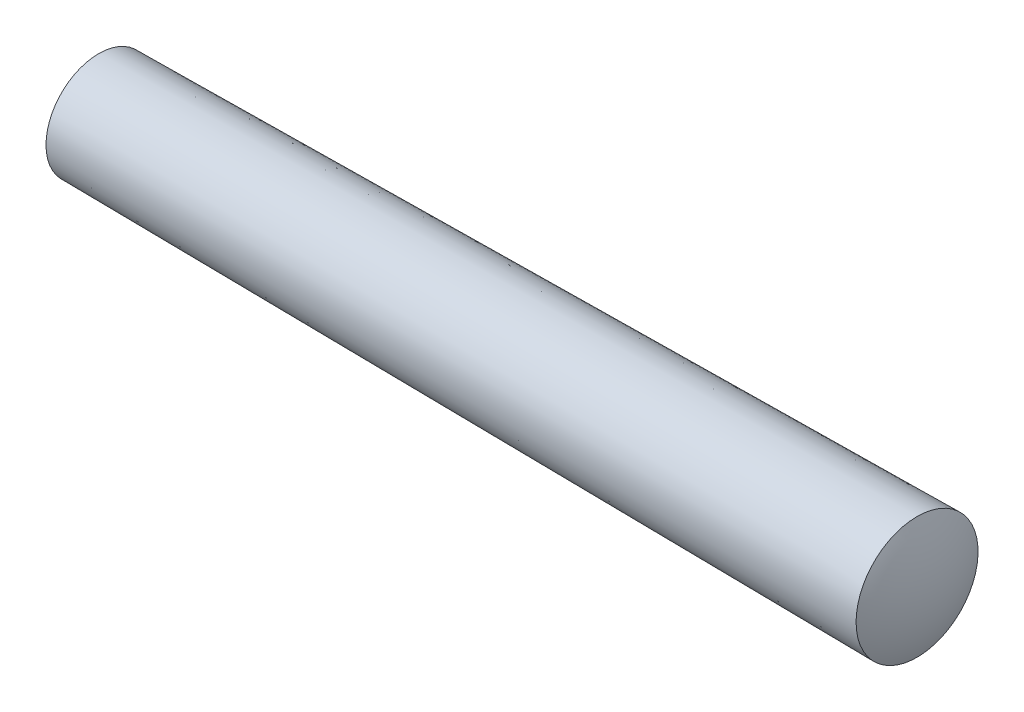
ISO-10303-21;
HEADER;
FILE_DESCRIPTION(('STEP AP214'),'2;1');
FILE_NAME('part.step','',(''),(''),'','','');
FILE_SCHEMA(('AUTOMOTIVE_DESIGN { 1 0 10303 214 1 1 1 1 }'));
ENDSEC;
DATA;
#1=APPLICATION_CONTEXT('core data for automotive mechanical design processes');
#2=APPLICATION_PROTOCOL_DEFINITION('international standard','automotive_design',2000,#1);
#3=PRODUCT_CONTEXT('',#1,'mechanical');
#4=PRODUCT('Part','Part','',(#3));
#5=PRODUCT_RELATED_PRODUCT_CATEGORY('part','',(#4));
#6=PRODUCT_DEFINITION_FORMATION('','',#4);
#7=PRODUCT_DEFINITION_CONTEXT('part definition',#1,'design');
#8=PRODUCT_DEFINITION('design','',#6,#7);
#9=PRODUCT_DEFINITION_SHAPE('','',#8);
#10=(LENGTH_UNIT() NAMED_UNIT(*) SI_UNIT(.MILLI.,.METRE.));
#11=(NAMED_UNIT(*) PLANE_ANGLE_UNIT() SI_UNIT($,.RADIAN.));
#12=(NAMED_UNIT(*) SI_UNIT($,.STERADIAN.) SOLID_ANGLE_UNIT());
#13=UNCERTAINTY_MEASURE_WITH_UNIT(LENGTH_MEASURE(1.E-05),#10,'distance_accuracy_value','');
#14=(GEOMETRIC_REPRESENTATION_CONTEXT(3) GLOBAL_UNCERTAINTY_ASSIGNED_CONTEXT((#13)) GLOBAL_UNIT_ASSIGNED_CONTEXT((#10,
#11,#12)) REPRESENTATION_CONTEXT('',''));
#15=CARTESIAN_POINT('',(0.,0.,0.));
#16=DIRECTION('',(0.,0.,1.));
#17=DIRECTION('',(1.,0.,0.));
#18=AXIS2_PLACEMENT_3D('',#15,#16,#17);
#19=CARTESIAN_POINT('',(33.068270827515,0.,0.));
#20=DIRECTION('',(-1.,0.,0.));
#21=DIRECTION('',(0.,1.,0.));
#22=AXIS2_PLACEMENT_3D('',#19,#20,#21);
#23=SPHERICAL_SURFACE('',#22,6.93172917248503);
#24=CARTESIAN_POINT('',(39.37,0.,0.));
#25=DIRECTION('',(-1.,0.,0.));
#26=DIRECTION('',(0.,0.,1.));
#27=AXIS2_PLACEMENT_3D('',#24,#25,#26);
#28=CIRCLE('',#27,2.88739999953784);
#29=CARTESIAN_POINT('',(39.37,0.,2.88739999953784));
#30=VERTEX_POINT('',#29);
#31=EDGE_CURVE('E43',#30,#30,#28,.T.);
#32=ORIENTED_EDGE('',*,*,#31,.F.);
#33=EDGE_LOOP('',(#32));
#34=FACE_BOUND('',#33,.T.);
#35=ADVANCED_FACE('F37',(#34),#23,.T.);
#36=CARTESIAN_POINT('',(5.27531746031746,0.,0.));
#37=DIRECTION('',(-1.,0.,0.));
#38=DIRECTION('',(0.,1.,0.));
#39=AXIS2_PLACEMENT_3D('',#36,#37,#38);
#40=SPHERICAL_SURFACE('',#39,5.27531746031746);
#41=CARTESIAN_POINT('',(0.63,0.,0.));
#42=DIRECTION('',(-1.,0.,0.));
#43=DIRECTION('',(0.,0.,1.));
#44=AXIS2_PLACEMENT_3D('',#41,#42,#43);
#45=CIRCLE('',#44,2.5);
#46=CARTESIAN_POINT('',(0.63,0.,2.5));
#47=VERTEX_POINT('',#46);
#48=EDGE_CURVE('E10',#47,#47,#45,.T.);
#49=ORIENTED_EDGE('',*,*,#48,.T.);
#50=EDGE_LOOP('',(#49));
#51=FACE_BOUND('',#50,.T.);
#52=ADVANCED_FACE('F52',(#51),#40,.T.);
#53=CARTESIAN_POINT('',(39.37,0.,0.));
#54=DIRECTION('',(1.,0.,0.));
#55=DIRECTION('',(0.,0.,-1.));
#56=AXIS2_PLACEMENT_3D('',#53,#54,#55);
#57=CONICAL_SURFACE('',#56,2.88739999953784,0.00999966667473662);
#58=ORIENTED_EDGE('',*,*,#48,.F.);
#59=EDGE_LOOP('',(#58));
#60=FACE_BOUND('',#59,.T.);
#61=ORIENTED_EDGE('',*,*,#31,.T.);
#62=EDGE_LOOP('',(#61));
#63=FACE_BOUND('',#62,.T.);
#64=ADVANCED_FACE('F49',(#60,#63),#57,.T.);
#65=CLOSED_SHELL('',(#35,#52,#64));
#66=MANIFOLD_SOLID_BREP('B2',#65);
#67=ADVANCED_BREP_SHAPE_REPRESENTATION('',(#18,#66),#14);
#68=SHAPE_DEFINITION_REPRESENTATION(#9,#67);
ENDSEC;
END-ISO-10303-21;
